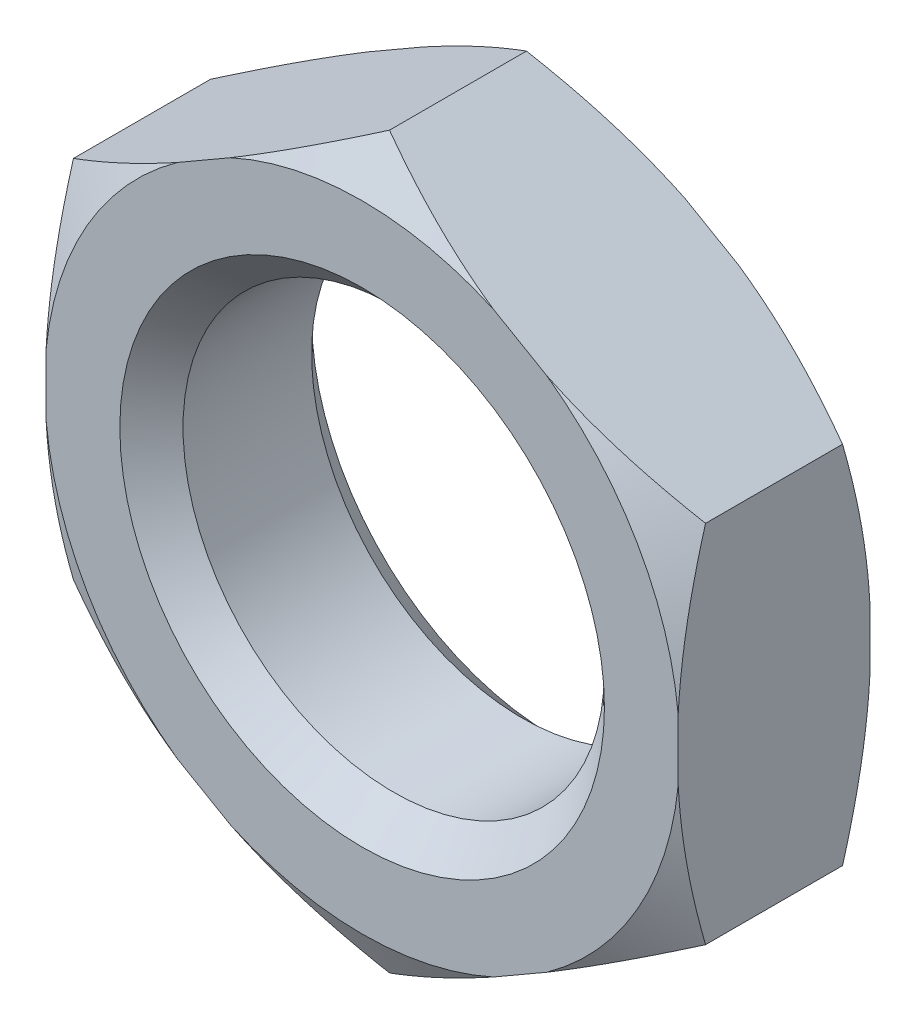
from build123d import *

# Parameters (mm, degrees)
BOSS_EXTRUDE1_DEPTH = 4.55
SKETCH6_R           = 10
CUT_EXTRUDE1_DEPTH  = 9.1
CHAMFER1_SIZE       = 1.5


with BuildPart() as part:
    # Sketch3 → Boss-Extrude1 (new, symmetric)
    with BuildSketch(Plane.XY):
        Polygon((0, 17.320508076), (-15, 8.660254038), (-15, -8.660254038), (0, -17.320508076), (15, -8.660254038), (15, 8.660254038), align=None)
    extrude(amount=BOSS_EXTRUDE1_DEPTH, both=True)

    # Sketch5 → Cut-Revolve1 (revolve, cut)
    with BuildSketch(Plane(origin=(0, 0, 0), x_dir=(0, 0, -1), z_dir=(1, 0, 0))):
        Polygon((-4.55, 17.320508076), (-4.55, 15.070508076), (-3.250961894, 17.320508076), align=None)
    cut_revolve1 = revolve(axis=Axis((0, 0, 5.457798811), (0, 0, -1)), mode=Mode.SUBTRACT)

    # Mirror1: Cut-Revolve1 across plane
    add(cut_revolve1.mirror(Plane.XY), mode=Mode.SUBTRACT)

    # Sketch6 → Cut-Extrude1 (cut)
    with BuildSketch(Plane.XY.offset(4.55)):
        Circle(SKETCH6_R)
    extrude(amount=-CUT_EXTRUDE1_DEPTH, mode=Mode.SUBTRACT)

    # Chamfer1
    chamfer1_edges = [part.edges().sort_by_distance(p)[0] for p in [
        (-10, 0, -4.55),
        (-10, 0, 4.55),
    ]]
    chamfer(chamfer1_edges, length=CHAMFER1_SIZE)


solid = part.part
